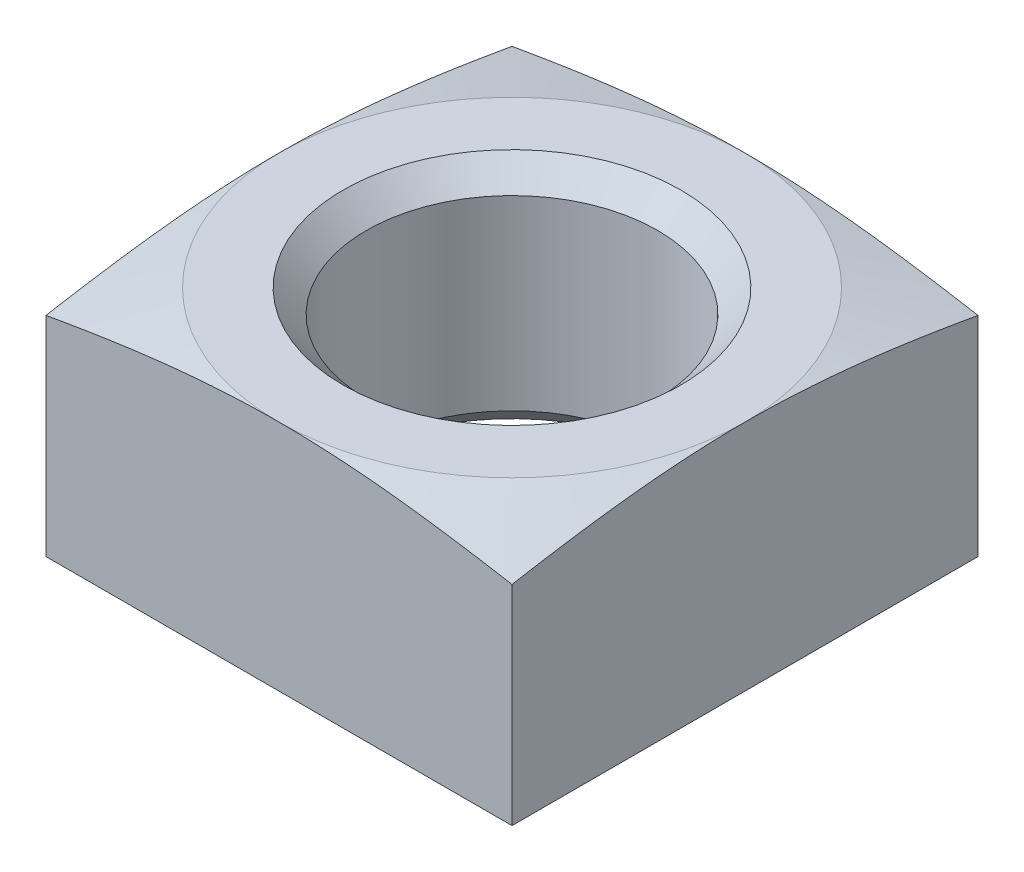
from build123d import *

# Parameters (mm, degrees)
SKETCH8_W           = 8
SKETCH8_H           = 4
BOSS_EXTRUDE2_DEPTH = 4
SKETCH11_R          = 2.5
CUT_EXTRUDE1_DEPTH  = 4
CHAMFER1_SIZE       = 0.4


with BuildPart() as part:
    # Sketch8 → Boss-Extrude2 (new, symmetric)
    with BuildSketch(Plane(origin=(0, 0, 0), x_dir=(0, 0, -1), z_dir=(1, 0, 0))):
        Rectangle(SKETCH8_W, SKETCH8_H)
    extrude(amount=BOSS_EXTRUDE2_DEPTH, both=True)

    # Sketch10 → Cut-Revolve1 (revolve, cut)
    with BuildSketch(Plane(origin=(0, 0, 0), x_dir=(0, 0, -1), z_dir=(1, 0, 0))):
        Polygon((-4, 2), (-6, 2), (-6, 1.5), align=None)
    revolve(axis=Axis((0, 59.838437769, 0), (0, -1, 0)), mode=Mode.SUBTRACT)

    # Sketch11 → Cut-Extrude1 (cut)
    with BuildSketch(Plane(origin=(0, 2, 0), x_dir=(1, 0, 0), z_dir=(0, 1, 0))):
        with Locations(Location((0, 0, 0), (0, 0, 270))):
            Circle(SKETCH11_R)
    extrude(amount=-CUT_EXTRUDE1_DEPTH, mode=Mode.SUBTRACT)

    # Chamfer1
    chamfer1_edges = [part.edges().sort_by_distance(p)[0] for p in [
        (0, 2, -2.5),
        (0, -2, -2.5),
    ]]
    chamfer(chamfer1_edges, length=CHAMFER1_SIZE)


solid = part.part
